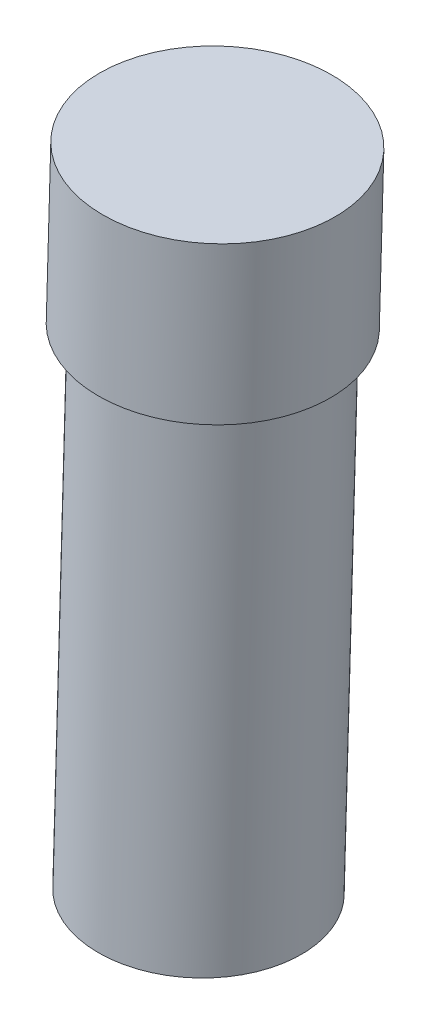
from build123d import *


with BuildPart() as part:
    # Esquisse1 → R_volution1 (revolve)
    with BuildSketch(Plane(origin=(0, 0, -134.221294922), x_dir=(-1, 0, 0), z_dir=(0, 0, -1)), mode=Mode.PRIVATE) as r_volution1_sk:
        Polygon((216.514306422, -43.297656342), (223.511408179, -43.096243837), (222.229314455, 1.443891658), (214.232626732, 1.213705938), (214.543520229, -9.586782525), (215.543106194, -9.55800931), align=None)
    revolve(r_volution1_sk.sketch.rotate(Axis((-223.517201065, -43.297489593, -134.221294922), (0.0287732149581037, 0.9995859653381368, 0)), 180), axis=Axis((-223.517201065, -43.297489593, -134.221294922), (0.0287732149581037, 0.9995859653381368, 0)))


solid = part.part
